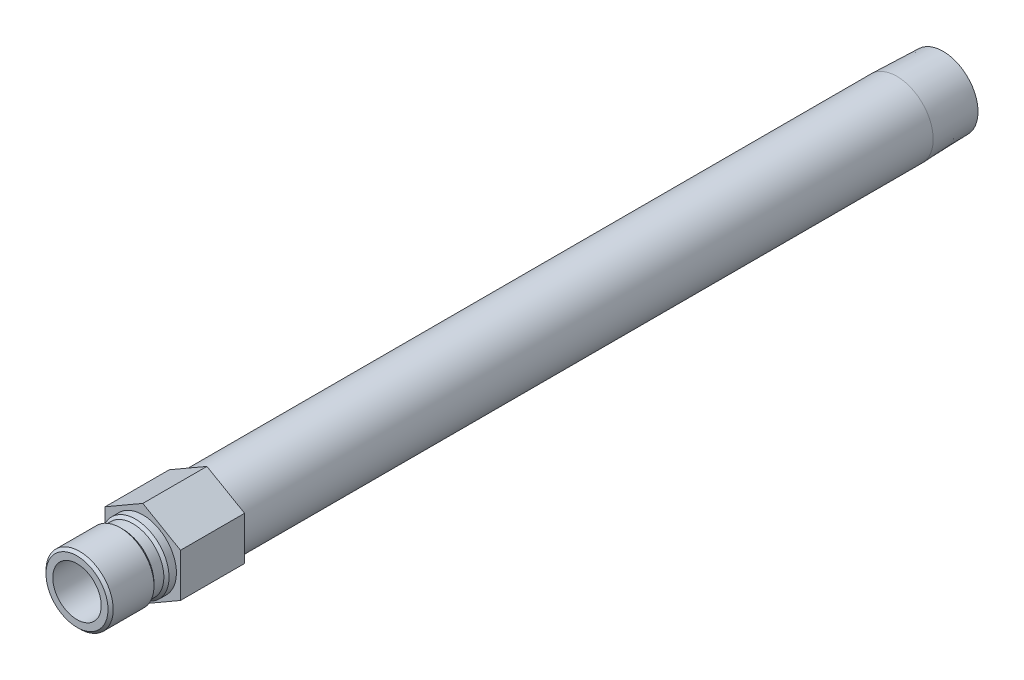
ISO-10303-21;
HEADER;
FILE_DESCRIPTION(('STEP AP214'),'2;1');
FILE_NAME('part.step','',(''),(''),'','','');
FILE_SCHEMA(('AUTOMOTIVE_DESIGN { 1 0 10303 214 1 1 1 1 }'));
ENDSEC;
DATA;
#1=APPLICATION_CONTEXT('core data for automotive mechanical design processes');
#2=APPLICATION_PROTOCOL_DEFINITION('international standard','automotive_design',2000,#1);
#3=PRODUCT_CONTEXT('',#1,'mechanical');
#4=PRODUCT('Part','Part','',(#3));
#5=PRODUCT_RELATED_PRODUCT_CATEGORY('part','',(#4));
#6=PRODUCT_DEFINITION_FORMATION('','',#4);
#7=PRODUCT_DEFINITION_CONTEXT('part definition',#1,'design');
#8=PRODUCT_DEFINITION('design','',#6,#7);
#9=PRODUCT_DEFINITION_SHAPE('','',#8);
#10=(LENGTH_UNIT() NAMED_UNIT(*) SI_UNIT(.MILLI.,.METRE.));
#11=(NAMED_UNIT(*) PLANE_ANGLE_UNIT() SI_UNIT($,.RADIAN.));
#12=(NAMED_UNIT(*) SI_UNIT($,.STERADIAN.) SOLID_ANGLE_UNIT());
#13=UNCERTAINTY_MEASURE_WITH_UNIT(LENGTH_MEASURE(1.E-05),#10,'distance_accuracy_value','');
#14=(GEOMETRIC_REPRESENTATION_CONTEXT(3) GLOBAL_UNCERTAINTY_ASSIGNED_CONTEXT((#13)) GLOBAL_UNIT_ASSIGNED_CONTEXT((#10,
#11,#12)) REPRESENTATION_CONTEXT('',''));
#15=CARTESIAN_POINT('',(0.,0.,0.));
#16=DIRECTION('',(0.,0.,1.));
#17=DIRECTION('',(1.,0.,0.));
#18=AXIS2_PLACEMENT_3D('',#15,#16,#17);
#19=CARTESIAN_POINT('',(0.,0.,0.));
#20=DIRECTION('',(0.,0.,-1.));
#21=DIRECTION('',(0.,1.,0.));
#22=AXIS2_PLACEMENT_3D('',#19,#20,#21);
#23=CYLINDRICAL_SURFACE('',#22,7.112);
#24=CARTESIAN_POINT('',(0.,0.,1.524));
#25=DIRECTION('',(0.,0.,-1.));
#26=DIRECTION('',(0.,1.,0.));
#27=AXIS2_PLACEMENT_3D('',#24,#25,#26);
#28=CIRCLE('',#27,7.112);
#29=CARTESIAN_POINT('',(0.,7.112,1.524));
#30=VERTEX_POINT('',#29);
#31=EDGE_CURVE('E147',#30,#30,#28,.T.);
#32=ORIENTED_EDGE('',*,*,#31,.T.);
#33=EDGE_LOOP('',(#32));
#34=FACE_BOUND('',#33,.T.);
#35=CARTESIAN_POINT('',(0.,0.,19.304));
#36=DIRECTION('',(0.,0.,-1.));
#37=DIRECTION('',(0.,1.,0.));
#38=AXIS2_PLACEMENT_3D('',#35,#36,#37);
#39=CIRCLE('',#38,7.112);
#40=CARTESIAN_POINT('',(0.,7.112,19.304));
#41=VERTEX_POINT('',#40);
#42=EDGE_CURVE('E42',#41,#41,#39,.T.);
#43=ORIENTED_EDGE('',*,*,#42,.F.);
#44=EDGE_LOOP('',(#43));
#45=FACE_BOUND('',#44,.T.);
#46=ADVANCED_FACE('F33',(#34,#45),#23,.F.);
#47=CARTESIAN_POINT('',(0.,7.112,19.304));
#48=DIRECTION('',(0.,0.,1.));
#49=DIRECTION('',(0.,-1.,0.));
#50=AXIS2_PLACEMENT_3D('',#47,#48,#49);
#51=PLANE('',#50);
#52=ORIENTED_EDGE('',*,*,#42,.T.);
#53=EDGE_LOOP('',(#52));
#54=FACE_BOUND('',#53,.T.);
#55=CARTESIAN_POINT('',(0.,0.,19.304));
#56=DIRECTION('',(0.,0.,-1.));
#57=DIRECTION('',(0.,1.,0.));
#58=AXIS2_PLACEMENT_3D('',#55,#56,#57);
#59=CIRCLE('',#58,9.0932);
#60=CARTESIAN_POINT('',(0.,9.0932,19.304));
#61=VERTEX_POINT('',#60);
#62=EDGE_CURVE('E180',#61,#61,#59,.T.);
#63=ORIENTED_EDGE('',*,*,#62,.F.);
#64=EDGE_LOOP('',(#63));
#65=FACE_BOUND('',#64,.T.);
#66=ADVANCED_FACE('F186',(#54,#65),#51,.T.);
#67=CARTESIAN_POINT('',(0.,0.,18.542));
#68=DIRECTION('',(0.,0.,-1.));
#69=DIRECTION('',(0.,1.,0.));
#70=AXIS2_PLACEMENT_3D('',#67,#68,#69);
#71=CONICAL_SURFACE('',#70,9.8552,0.785398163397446);
#72=ORIENTED_EDGE('',*,*,#62,.T.);
#73=EDGE_LOOP('',(#72));
#74=FACE_BOUND('',#73,.T.);
#75=CARTESIAN_POINT('',(0.,0.,18.542));
#76=DIRECTION('',(0.,0.,-1.));
#77=DIRECTION('',(0.,1.,0.));
#78=AXIS2_PLACEMENT_3D('',#75,#76,#77);
#79=CIRCLE('',#78,9.8552);
#80=CARTESIAN_POINT('',(0.,9.8552,18.542));
#81=VERTEX_POINT('',#80);
#82=EDGE_CURVE('E177',#81,#81,#79,.T.);
#83=ORIENTED_EDGE('',*,*,#82,.F.);
#84=EDGE_LOOP('',(#83));
#85=FACE_BOUND('',#84,.T.);
#86=ADVANCED_FACE('F194',(#74,#85),#71,.T.);
#87=CARTESIAN_POINT('',(0.,0.,0.));
#88=DIRECTION('',(0.,0.,-1.));
#89=DIRECTION('',(0.,1.,0.));
#90=AXIS2_PLACEMENT_3D('',#87,#88,#89);
#91=CYLINDRICAL_SURFACE('',#90,9.8552);
#92=ORIENTED_EDGE('',*,*,#82,.T.);
#93=EDGE_LOOP('',(#92));
#94=FACE_BOUND('',#93,.T.);
#95=CARTESIAN_POINT('',(0.,0.,6.5786));
#96=DIRECTION('',(0.,0.,-1.));
#97=DIRECTION('',(0.,1.,0.));
#98=AXIS2_PLACEMENT_3D('',#95,#96,#97);
#99=CIRCLE('',#98,9.8552);
#100=CARTESIAN_POINT('',(0.,9.8552,6.5786));
#101=VERTEX_POINT('',#100);
#102=EDGE_CURVE('E174',#101,#101,#99,.T.);
#103=ORIENTED_EDGE('',*,*,#102,.F.);
#104=EDGE_LOOP('',(#103));
#105=FACE_BOUND('',#104,.T.);
#106=ADVANCED_FACE('F249',(#94,#105),#91,.T.);
#107=CARTESIAN_POINT('',(0.,0.,5.8166));
#108=DIRECTION('',(0.,0.,1.));
#109=DIRECTION('',(0.,-1.,0.));
#110=AXIS2_PLACEMENT_3D('',#107,#108,#109);
#111=CONICAL_SURFACE('',#110,9.0932,0.785398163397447);
#112=ORIENTED_EDGE('',*,*,#102,.T.);
#113=EDGE_LOOP('',(#112));
#114=FACE_BOUND('',#113,.T.);
#115=CARTESIAN_POINT('',(0.,0.,5.8166));
#116=DIRECTION('',(0.,0.,-1.));
#117=DIRECTION('',(0.,1.,0.));
#118=AXIS2_PLACEMENT_3D('',#115,#116,#117);
#119=CIRCLE('',#118,9.0932);
#120=CARTESIAN_POINT('',(0.,9.0932,5.8166));
#121=VERTEX_POINT('',#120);
#122=EDGE_CURVE('E171',#121,#121,#119,.T.);
#123=ORIENTED_EDGE('',*,*,#122,.F.);
#124=EDGE_LOOP('',(#123));
#125=FACE_BOUND('',#124,.T.);
#126=ADVANCED_FACE('F245',(#114,#125),#111,.T.);
#127=CARTESIAN_POINT('',(0.,0.,0.));
#128=DIRECTION('',(0.,0.,-1.));
#129=DIRECTION('',(0.,1.,0.));
#130=AXIS2_PLACEMENT_3D('',#127,#128,#129);
#131=CYLINDRICAL_SURFACE('',#130,9.0932);
#132=ORIENTED_EDGE('',*,*,#122,.T.);
#133=EDGE_LOOP('',(#132));
#134=FACE_BOUND('',#133,.T.);
#135=CARTESIAN_POINT('',(0.,0.,2.921));
#136=DIRECTION('',(0.,0.,-1.));
#137=DIRECTION('',(0.,1.,0.));
#138=AXIS2_PLACEMENT_3D('',#135,#136,#137);
#139=CIRCLE('',#138,9.0932);
#140=CARTESIAN_POINT('',(0.,9.0932,2.921));
#141=VERTEX_POINT('',#140);
#142=EDGE_CURVE('E168',#141,#141,#139,.T.);
#143=ORIENTED_EDGE('',*,*,#142,.F.);
#144=EDGE_LOOP('',(#143));
#145=FACE_BOUND('',#144,.T.);
#146=ADVANCED_FACE('F241',(#134,#145),#131,.T.);
#147=CARTESIAN_POINT('',(0.,0.,2.159));
#148=DIRECTION('',(0.,0.,-1.));
#149=DIRECTION('',(0.,1.,0.));
#150=AXIS2_PLACEMENT_3D('',#147,#148,#149);
#151=CONICAL_SURFACE('',#150,9.8552,0.785398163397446);
#152=ORIENTED_EDGE('',*,*,#142,.T.);
#153=EDGE_LOOP('',(#152));
#154=FACE_BOUND('',#153,.T.);
#155=CARTESIAN_POINT('',(0.,0.,2.159));
#156=DIRECTION('',(0.,0.,-1.));
#157=DIRECTION('',(0.,1.,0.));
#158=AXIS2_PLACEMENT_3D('',#155,#156,#157);
#159=CIRCLE('',#158,9.8552);
#160=CARTESIAN_POINT('',(0.,9.8552,2.159));
#161=VERTEX_POINT('',#160);
#162=EDGE_CURVE('E165',#161,#161,#159,.T.);
#163=ORIENTED_EDGE('',*,*,#162,.F.);
#164=EDGE_LOOP('',(#163));
#165=FACE_BOUND('',#164,.T.);
#166=ADVANCED_FACE('F237',(#154,#165),#151,.T.);
#167=CARTESIAN_POINT('',(0.,0.,0.));
#168=DIRECTION('',(0.,0.,-1.));
#169=DIRECTION('',(0.,1.,0.));
#170=AXIS2_PLACEMENT_3D('',#167,#168,#169);
#171=CYLINDRICAL_SURFACE('',#170,9.8552);
#172=ORIENTED_EDGE('',*,*,#162,.T.);
#173=EDGE_LOOP('',(#172));
#174=FACE_BOUND('',#173,.T.);
#175=CARTESIAN_POINT('',(0.,0.,0.));
#176=DIRECTION('',(0.,0.,-1.));
#177=DIRECTION('',(0.,1.,0.));
#178=AXIS2_PLACEMENT_3D('',#175,#176,#177);
#179=CIRCLE('',#178,9.8552);
#180=CARTESIAN_POINT('',(0.,9.8552,0.));
#181=VERTEX_POINT('',#180);
#182=EDGE_CURVE('E162',#181,#181,#179,.T.);
#183=ORIENTED_EDGE('',*,*,#182,.F.);
#184=EDGE_LOOP('',(#183));
#185=FACE_BOUND('',#184,.T.);
#186=ADVANCED_FACE('F233',(#174,#185),#171,.T.);
#187=CARTESIAN_POINT('',(0.,9.8552,0.));
#188=DIRECTION('',(0.,0.,1.));
#189=DIRECTION('',(0.,-1.,0.));
#190=AXIS2_PLACEMENT_3D('',#187,#188,#189);
#191=PLANE('',#190);
#192=ORIENTED_EDGE('',*,*,#182,.T.);
#193=EDGE_LOOP('',(#192));
#194=FACE_BOUND('',#193,.T.);
#195=DIRECTION('',(-0.866025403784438,-0.5,0.));
#196=VECTOR('',#195,1.);
#197=CARTESIAN_POINT('',(0.,12.7582862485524,0.));
#198=LINE('',#197,#196);
#199=CARTESIAN_POINT('',(0.,12.7582862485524,0.));
#200=VERTEX_POINT('',#199);
#201=CARTESIAN_POINT('',(-11.049,6.37914312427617,0.));
#202=VERTEX_POINT('',#201);
#203=EDGE_CURVE('E121',#200,#202,#198,.T.);
#204=ORIENTED_EDGE('',*,*,#203,.T.);
#205=DIRECTION('',(0.,-1.,0.));
#206=VECTOR('',#205,1.);
#207=CARTESIAN_POINT('',(-11.049,6.37914312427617,0.));
#208=LINE('',#207,#206);
#209=CARTESIAN_POINT('',(-11.049,-6.37914312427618,0.));
#210=VERTEX_POINT('',#209);
#211=EDGE_CURVE('E124',#202,#210,#208,.T.);
#212=ORIENTED_EDGE('',*,*,#211,.T.);
#213=DIRECTION('',(0.866025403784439,-0.5,0.));
#214=VECTOR('',#213,1.);
#215=CARTESIAN_POINT('',(-11.049,-6.37914312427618,0.));
#216=LINE('',#215,#214);
#217=CARTESIAN_POINT('',(0.,-12.7582862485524,0.));
#218=VERTEX_POINT('',#217);
#219=EDGE_CURVE('E128',#210,#218,#216,.T.);
#220=ORIENTED_EDGE('',*,*,#219,.T.);
#221=DIRECTION('',(0.866025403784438,0.5,0.));
#222=VECTOR('',#221,1.);
#223=CARTESIAN_POINT('',(0.,-12.7582862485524,0.));
#224=LINE('',#223,#222);
#225=CARTESIAN_POINT('',(11.049,-6.37914312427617,0.));
#226=VERTEX_POINT('',#225);
#227=EDGE_CURVE('E131',#218,#226,#224,.T.);
#228=ORIENTED_EDGE('',*,*,#227,.T.);
#229=DIRECTION('',(0.,1.,0.));
#230=VECTOR('',#229,1.);
#231=CARTESIAN_POINT('',(11.049,-6.37914312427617,0.));
#232=LINE('',#231,#230);
#233=CARTESIAN_POINT('',(11.049,6.37914312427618,0.));
#234=VERTEX_POINT('',#233);
#235=EDGE_CURVE('E98',#226,#234,#232,.T.);
#236=ORIENTED_EDGE('',*,*,#235,.T.);
#237=DIRECTION('',(-0.866025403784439,0.5,0.));
#238=VECTOR('',#237,1.);
#239=CARTESIAN_POINT('',(11.049,6.37914312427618,0.));
#240=LINE('',#239,#238);
#241=EDGE_CURVE('E134',#234,#200,#240,.T.);
#242=ORIENTED_EDGE('',*,*,#241,.T.);
#243=EDGE_LOOP('',(#204,#212,#220,#228,#236,#242));
#244=FACE_BOUND('',#243,.T.);
#245=ADVANCED_FACE('F210',(#194,#244),#191,.T.);
#246=CARTESIAN_POINT('',(0.,0.,0.));
#247=DIRECTION('',(0.,0.,-1.));
#248=DIRECTION('',(0.,1.,0.));
#249=AXIS2_PLACEMENT_3D('',#246,#247,#248);
#250=CYLINDRICAL_SURFACE('',#249,7.89939999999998);
#251=CARTESIAN_POINT('',(0.,0.,0.));
#252=DIRECTION('',(0.,0.,1.));
#253=DIRECTION('',(1.,0.,0.));
#254=AXIS2_PLACEMENT_3D('',#251,#252,#253);
#255=CIRCLE('',#254,7.89939999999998);
#256=CARTESIAN_POINT('',(7.89939999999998,0.,0.));
#257=VERTEX_POINT('',#256);
#258=EDGE_CURVE('E11',#257,#257,#255,.T.);
#259=ORIENTED_EDGE('',*,*,#258,.F.);
#260=EDGE_LOOP('',(#259));
#261=FACE_BOUND('',#260,.T.);
#262=CARTESIAN_POINT('',(0.,0.,1.10533199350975));
#263=DIRECTION('',(0.,0.,-1.));
#264=DIRECTION('',(0.,1.,0.));
#265=AXIS2_PLACEMENT_3D('',#262,#263,#264);
#266=CIRCLE('',#265,7.8994);
#267=CARTESIAN_POINT('',(0.,7.8994,1.10533199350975));
#268=VERTEX_POINT('',#267);
#269=EDGE_CURVE('E150',#268,#268,#266,.T.);
#270=ORIENTED_EDGE('',*,*,#269,.F.);
#271=EDGE_LOOP('',(#270));
#272=FACE_BOUND('',#271,.T.);
#273=ADVANCED_FACE('F200',(#261,#272),#250,.F.);
#274=CARTESIAN_POINT('',(0.,0.,1.524));
#275=DIRECTION('',(0.,0.,-1.));
#276=DIRECTION('',(0.,1.,0.));
#277=AXIS2_PLACEMENT_3D('',#274,#275,#276);
#278=CONICAL_SURFACE('',#277,7.112,1.08210413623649);
#279=ORIENTED_EDGE('',*,*,#269,.T.);
#280=EDGE_LOOP('',(#279));
#281=FACE_BOUND('',#280,.T.);
#282=ORIENTED_EDGE('',*,*,#31,.F.);
#283=EDGE_LOOP('',(#282));
#284=FACE_BOUND('',#283,.T.);
#285=ADVANCED_FACE('F197',(#281,#284),#278,.F.);
#286=CARTESIAN_POINT('',(-11.049,6.37914312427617,-18.796));
#287=DIRECTION('',(0.,0.,1.));
#288=DIRECTION('',(1.,0.,0.));
#289=AXIS2_PLACEMENT_3D('',#286,#287,#288);
#290=PLANE('',#289);
#291=CARTESIAN_POINT('',(0.,0.,-18.796));
#292=DIRECTION('',(0.,0.,1.));
#293=DIRECTION('',(1.,0.,0.));
#294=AXIS2_PLACEMENT_3D('',#291,#292,#293);
#295=CIRCLE('',#294,7.89939999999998);
#296=CARTESIAN_POINT('',(7.89939999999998,0.,-18.796));
#297=VERTEX_POINT('',#296);
#298=EDGE_CURVE('E36',#297,#297,#295,.T.);
#299=ORIENTED_EDGE('',*,*,#298,.F.);
#300=EDGE_LOOP('',(#299));
#301=FACE_BOUND('',#300,.T.);
#302=CARTESIAN_POINT('',(0.,0.,-18.796));
#303=DIRECTION('',(0.,0.,1.));
#304=DIRECTION('',(1.,0.,0.));
#305=AXIS2_PLACEMENT_3D('',#302,#303,#304);
#306=CIRCLE('',#305,7.112);
#307=CARTESIAN_POINT('',(7.112,0.,-18.796));
#308=VERTEX_POINT('',#307);
#309=EDGE_CURVE('E125',#308,#308,#306,.T.);
#310=ORIENTED_EDGE('',*,*,#309,.T.);
#311=EDGE_LOOP('',(#310));
#312=FACE_BOUND('',#311,.T.);
#313=ADVANCED_FACE('F199',(#301,#312),#290,.F.);
#314=CARTESIAN_POINT('',(0.,0.,-18.796));
#315=DIRECTION('',(0.,0.,1.));
#316=DIRECTION('',(1.,0.,0.));
#317=AXIS2_PLACEMENT_3D('',#314,#315,#316);
#318=CYLINDRICAL_SURFACE('',#317,7.112);
#319=ORIENTED_EDGE('',*,*,#309,.F.);
#320=EDGE_LOOP('',(#319));
#321=FACE_BOUND('',#320,.T.);
#322=CARTESIAN_POINT('',(0.,0.,0.));
#323=DIRECTION('',(0.,0.,1.));
#324=DIRECTION('',(1.,0.,0.));
#325=AXIS2_PLACEMENT_3D('',#322,#323,#324);
#326=CIRCLE('',#325,7.112);
#327=CARTESIAN_POINT('',(7.112,0.,0.));
#328=VERTEX_POINT('',#327);
#329=EDGE_CURVE('E443',#328,#328,#326,.T.);
#330=ORIENTED_EDGE('',*,*,#329,.T.);
#331=EDGE_LOOP('',(#330));
#332=FACE_BOUND('',#331,.T.);
#333=ADVANCED_FACE('F207',(#321,#332),#318,.F.);
#334=CARTESIAN_POINT('',(-11.049,6.37914312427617,0.));
#335=DIRECTION('',(0.,0.,1.));
#336=DIRECTION('',(1.,0.,0.));
#337=AXIS2_PLACEMENT_3D('',#334,#335,#336);
#338=PLANE('',#337);
#339=ORIENTED_EDGE('',*,*,#258,.T.);
#340=EDGE_LOOP('',(#339));
#341=FACE_BOUND('',#340,.T.);
#342=ORIENTED_EDGE('',*,*,#329,.F.);
#343=EDGE_LOOP('',(#342));
#344=FACE_BOUND('',#343,.T.);
#345=ADVANCED_FACE('F221',(#341,#344),#338,.T.);
#346=CARTESIAN_POINT('',(0.,10.244140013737,-234.696));
#347=DIRECTION('',(0.,0.,-1.));
#348=DIRECTION('',(0.,1.,0.));
#349=AXIS2_PLACEMENT_3D('',#346,#347,#348);
#350=PLANE('',#349);
#351=CARTESIAN_POINT('',(0.,0.,-234.696));
#352=DIRECTION('',(0.,0.,-1.));
#353=DIRECTION('',(0.,1.,0.));
#354=AXIS2_PLACEMENT_3D('',#351,#352,#353);
#355=CIRCLE('',#354,10.2441400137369);
#356=CARTESIAN_POINT('',(0.,10.244140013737,-234.696));
#357=VERTEX_POINT('',#356);
#358=EDGE_CURVE('E156',#357,#357,#355,.T.);
#359=ORIENTED_EDGE('',*,*,#358,.T.);
#360=EDGE_LOOP('',(#359));
#361=FACE_BOUND('',#360,.T.);
#362=CARTESIAN_POINT('',(0.,0.,-234.696));
#363=DIRECTION('',(0.,0.,-1.));
#364=DIRECTION('',(0.,1.,0.));
#365=AXIS2_PLACEMENT_3D('',#362,#363,#364);
#366=CIRCLE('',#365,7.89939999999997);
#367=CARTESIAN_POINT('',(0.,7.8994,-234.696));
#368=VERTEX_POINT('',#367);
#369=EDGE_CURVE('E153',#368,#368,#366,.T.);
#370=ORIENTED_EDGE('',*,*,#369,.F.);
#371=EDGE_LOOP('',(#370));
#372=FACE_BOUND('',#371,.T.);
#373=ADVANCED_FACE('F218',(#361,#372),#350,.T.);
#374=ORIENTED_EDGE('',*,*,#369,.T.);
#375=EDGE_LOOP('',(#374));
#376=FACE_BOUND('',#375,.T.);
#377=ORIENTED_EDGE('',*,*,#298,.T.);
#378=EDGE_LOOP('',(#377));
#379=FACE_BOUND('',#378,.T.);
#380=ADVANCED_FACE('F213',(#376,#379),#250,.F.);
#381=CARTESIAN_POINT('',(0.,0.,-234.696));
#382=DIRECTION('',(0.,0.,1.));
#383=DIRECTION('',(0.,-1.,0.));
#384=AXIS2_PLACEMENT_3D('',#381,#382,#383);
#385=CONICAL_SURFACE('',#384,10.2441400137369,0.0312396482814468);
#386=CARTESIAN_POINT('',(0.,0.,-221.1324));
#387=DIRECTION('',(0.,0.,-1.));
#388=DIRECTION('',(0.,1.,0.));
#389=AXIS2_PLACEMENT_3D('',#386,#387,#388);
#390=CIRCLE('',#389,10.668);
#391=CARTESIAN_POINT('',(0.,10.668,-221.1324));
#392=VERTEX_POINT('',#391);
#393=EDGE_CURVE('E159',#392,#392,#390,.T.);
#394=ORIENTED_EDGE('',*,*,#393,.T.);
#395=EDGE_LOOP('',(#394));
#396=FACE_BOUND('',#395,.T.);
#397=ORIENTED_EDGE('',*,*,#358,.F.);
#398=EDGE_LOOP('',(#397));
#399=FACE_BOUND('',#398,.T.);
#400=ADVANCED_FACE('F223',(#396,#399),#385,.T.);
#401=CARTESIAN_POINT('',(0.,0.,0.));
#402=DIRECTION('',(0.,0.,-1.));
#403=DIRECTION('',(0.,1.,0.));
#404=AXIS2_PLACEMENT_3D('',#401,#402,#403);
#405=CYLINDRICAL_SURFACE('',#404,10.668);
#406=ORIENTED_EDGE('',*,*,#393,.F.);
#407=EDGE_LOOP('',(#406));
#408=FACE_BOUND('',#407,.T.);
#409=CARTESIAN_POINT('',(0.,0.,-18.796));
#410=DIRECTION('',(0.,0.,1.));
#411=DIRECTION('',(1.,0.,0.));
#412=AXIS2_PLACEMENT_3D('',#409,#410,#411);
#413=CIRCLE('',#412,10.668);
#414=CARTESIAN_POINT('',(10.668,0.,-18.796));
#415=VERTEX_POINT('',#414);
#416=EDGE_CURVE('E144',#415,#415,#413,.F.);
#417=ORIENTED_EDGE('',*,*,#416,.T.);
#418=EDGE_LOOP('',(#417));
#419=FACE_BOUND('',#418,.T.);
#420=ADVANCED_FACE('F226',(#408,#419),#405,.T.);
#421=ORIENTED_EDGE('',*,*,#416,.F.);
#422=EDGE_LOOP('',(#421));
#423=FACE_BOUND('',#422,.T.);
#424=DIRECTION('',(-0.866025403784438,-0.5,0.));
#425=VECTOR('',#424,1.);
#426=CARTESIAN_POINT('',(0.,12.7582862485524,-18.796));
#427=LINE('',#426,#425);
#428=CARTESIAN_POINT('',(0.,12.7582862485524,-18.796));
#429=VERTEX_POINT('',#428);
#430=CARTESIAN_POINT('',(-11.049,6.37914312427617,-18.796));
#431=VERTEX_POINT('',#430);
#432=EDGE_CURVE('E137',#429,#431,#427,.T.);
#433=ORIENTED_EDGE('',*,*,#432,.F.);
#434=DIRECTION('',(-0.866025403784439,0.5,0.));
#435=VECTOR('',#434,1.);
#436=CARTESIAN_POINT('',(11.049,6.37914312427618,-18.796));
#437=LINE('',#436,#435);
#438=CARTESIAN_POINT('',(11.049,6.37914312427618,-18.796));
#439=VERTEX_POINT('',#438);
#440=EDGE_CURVE('E111',#439,#429,#437,.T.);
#441=ORIENTED_EDGE('',*,*,#440,.F.);
#442=DIRECTION('',(0.,1.,0.));
#443=VECTOR('',#442,1.);
#444=CARTESIAN_POINT('',(11.049,-6.37914312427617,-18.796));
#445=LINE('',#444,#443);
#446=CARTESIAN_POINT('',(11.049,-6.37914312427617,-18.796));
#447=VERTEX_POINT('',#446);
#448=EDGE_CURVE('E96',#447,#439,#445,.T.);
#449=ORIENTED_EDGE('',*,*,#448,.F.);
#450=DIRECTION('',(0.866025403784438,0.5,0.));
#451=VECTOR('',#450,1.);
#452=CARTESIAN_POINT('',(0.,-12.7582862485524,-18.796));
#453=LINE('',#452,#451);
#454=CARTESIAN_POINT('',(0.,-12.7582862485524,-18.796));
#455=VERTEX_POINT('',#454);
#456=EDGE_CURVE('E109',#455,#447,#453,.T.);
#457=ORIENTED_EDGE('',*,*,#456,.F.);
#458=DIRECTION('',(0.866025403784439,-0.5,0.));
#459=VECTOR('',#458,1.);
#460=CARTESIAN_POINT('',(-11.049,-6.37914312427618,-18.796));
#461=LINE('',#460,#459);
#462=CARTESIAN_POINT('',(-11.049,-6.37914312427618,-18.796));
#463=VERTEX_POINT('',#462);
#464=EDGE_CURVE('E114',#463,#455,#461,.T.);
#465=ORIENTED_EDGE('',*,*,#464,.F.);
#466=DIRECTION('',(0.,-1.,0.));
#467=VECTOR('',#466,1.);
#468=CARTESIAN_POINT('',(-11.049,6.37914312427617,-18.796));
#469=LINE('',#468,#467);
#470=EDGE_CURVE('E116',#431,#463,#469,.T.);
#471=ORIENTED_EDGE('',*,*,#470,.F.);
#472=EDGE_LOOP('',(#433,#441,#449,#457,#465,#471));
#473=FACE_BOUND('',#472,.T.);
#474=ADVANCED_FACE('F107',(#423,#473),#290,.F.);
#475=CARTESIAN_POINT('',(0.,12.7582862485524,-18.796));
#476=DIRECTION('',(-0.5,0.866025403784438,0.));
#477=DIRECTION('',(-0.866025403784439,-0.5,0.));
#478=AXIS2_PLACEMENT_3D('',#475,#476,#477);
#479=PLANE('',#478);
#480=ORIENTED_EDGE('',*,*,#203,.F.);
#481=DIRECTION('',(0.,0.,1.));
#482=VECTOR('',#481,1.);
#483=CARTESIAN_POINT('',(0.,12.7582862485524,-18.796));
#484=LINE('',#483,#482);
#485=EDGE_CURVE('E50',#429,#200,#484,.T.);
#486=ORIENTED_EDGE('',*,*,#485,.F.);
#487=ORIENTED_EDGE('',*,*,#432,.T.);
#488=DIRECTION('',(0.,0.,1.));
#489=VECTOR('',#488,1.);
#490=CARTESIAN_POINT('',(-11.049,6.37914312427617,-18.796));
#491=LINE('',#490,#489);
#492=EDGE_CURVE('E85',#431,#202,#491,.T.);
#493=ORIENTED_EDGE('',*,*,#492,.T.);
#494=EDGE_LOOP('',(#480,#486,#487,#493));
#495=FACE_BOUND('',#494,.T.);
#496=ADVANCED_FACE('F215',(#495),#479,.T.);
#497=CARTESIAN_POINT('',(11.049,6.37914312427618,-18.796));
#498=DIRECTION('',(0.5,0.866025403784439,0.));
#499=DIRECTION('',(-0.866025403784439,0.5,0.));
#500=AXIS2_PLACEMENT_3D('',#497,#498,#499);
#501=PLANE('',#500);
#502=ORIENTED_EDGE('',*,*,#241,.F.);
#503=DIRECTION('',(0.,0.,1.));
#504=VECTOR('',#503,1.);
#505=CARTESIAN_POINT('',(11.049,6.37914312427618,-18.796));
#506=LINE('',#505,#504);
#507=EDGE_CURVE('E73',#439,#234,#506,.T.);
#508=ORIENTED_EDGE('',*,*,#507,.F.);
#509=ORIENTED_EDGE('',*,*,#440,.T.);
#510=ORIENTED_EDGE('',*,*,#485,.T.);
#511=EDGE_LOOP('',(#502,#508,#509,#510));
#512=FACE_BOUND('',#511,.T.);
#513=ADVANCED_FACE('F276',(#512),#501,.T.);
#514=CARTESIAN_POINT('',(11.049,-6.37914312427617,-18.796));
#515=DIRECTION('',(1.,0.,0.));
#516=DIRECTION('',(0.,1.,0.));
#517=AXIS2_PLACEMENT_3D('',#514,#515,#516);
#518=PLANE('',#517);
#519=ORIENTED_EDGE('',*,*,#235,.F.);
#520=DIRECTION('',(0.,0.,1.));
#521=VECTOR('',#520,1.);
#522=CARTESIAN_POINT('',(11.049,-6.37914312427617,-18.796));
#523=LINE('',#522,#521);
#524=EDGE_CURVE('E93',#447,#226,#523,.T.);
#525=ORIENTED_EDGE('',*,*,#524,.F.);
#526=ORIENTED_EDGE('',*,*,#448,.T.);
#527=ORIENTED_EDGE('',*,*,#507,.T.);
#528=EDGE_LOOP('',(#519,#525,#526,#527));
#529=FACE_BOUND('',#528,.T.);
#530=ADVANCED_FACE('F95',(#529),#518,.T.);
#531=CARTESIAN_POINT('',(0.,-12.7582862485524,-18.796));
#532=DIRECTION('',(0.5,-0.866025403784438,0.));
#533=DIRECTION('',(0.866025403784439,0.5,0.));
#534=AXIS2_PLACEMENT_3D('',#531,#532,#533);
#535=PLANE('',#534);
#536=ORIENTED_EDGE('',*,*,#227,.F.);
#537=DIRECTION('',(0.,0.,1.));
#538=VECTOR('',#537,1.);
#539=CARTESIAN_POINT('',(0.,-12.7582862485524,-18.796));
#540=LINE('',#539,#538);
#541=EDGE_CURVE('E103',#455,#218,#540,.T.);
#542=ORIENTED_EDGE('',*,*,#541,.F.);
#543=ORIENTED_EDGE('',*,*,#456,.T.);
#544=ORIENTED_EDGE('',*,*,#524,.T.);
#545=EDGE_LOOP('',(#536,#542,#543,#544));
#546=FACE_BOUND('',#545,.T.);
#547=ADVANCED_FACE('F113',(#546),#535,.T.);
#548=CARTESIAN_POINT('',(-11.049,-6.37914312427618,-18.796));
#549=DIRECTION('',(-0.5,-0.866025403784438,0.));
#550=DIRECTION('',(0.866025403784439,-0.5,0.));
#551=AXIS2_PLACEMENT_3D('',#548,#549,#550);
#552=PLANE('',#551);
#553=ORIENTED_EDGE('',*,*,#219,.F.);
#554=DIRECTION('',(0.,0.,1.));
#555=VECTOR('',#554,1.);
#556=CARTESIAN_POINT('',(-11.049,-6.37914312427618,-18.796));
#557=LINE('',#556,#555);
#558=EDGE_CURVE('E141',#463,#210,#557,.T.);
#559=ORIENTED_EDGE('',*,*,#558,.F.);
#560=ORIENTED_EDGE('',*,*,#464,.T.);
#561=ORIENTED_EDGE('',*,*,#541,.T.);
#562=EDGE_LOOP('',(#553,#559,#560,#561));
#563=FACE_BOUND('',#562,.T.);
#564=ADVANCED_FACE('F275',(#563),#552,.T.);
#565=CARTESIAN_POINT('',(-11.049,6.37914312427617,-18.796));
#566=DIRECTION('',(-1.,0.,0.));
#567=DIRECTION('',(0.,0.,1.));
#568=AXIS2_PLACEMENT_3D('',#565,#566,#567);
#569=PLANE('',#568);
#570=ORIENTED_EDGE('',*,*,#211,.F.);
#571=ORIENTED_EDGE('',*,*,#492,.F.);
#572=ORIENTED_EDGE('',*,*,#470,.T.);
#573=ORIENTED_EDGE('',*,*,#558,.T.);
#574=EDGE_LOOP('',(#570,#571,#572,#573));
#575=FACE_BOUND('',#574,.T.);
#576=ADVANCED_FACE('F272',(#575),#569,.T.);
#577=CLOSED_SHELL('',(#46,#66,#86,#106,#126,#146,#166,#186,#245,#273,#285,#313,#333,#345,#373,
#380,#400,#420,#474,#496,#513,#530,#547,#564,#576));
#578=MANIFOLD_SOLID_BREP('B2',#577);
#579=ADVANCED_BREP_SHAPE_REPRESENTATION('',(#18,#578),#14);
#580=SHAPE_DEFINITION_REPRESENTATION(#9,#579);
ENDSEC;
END-ISO-10303-21;
